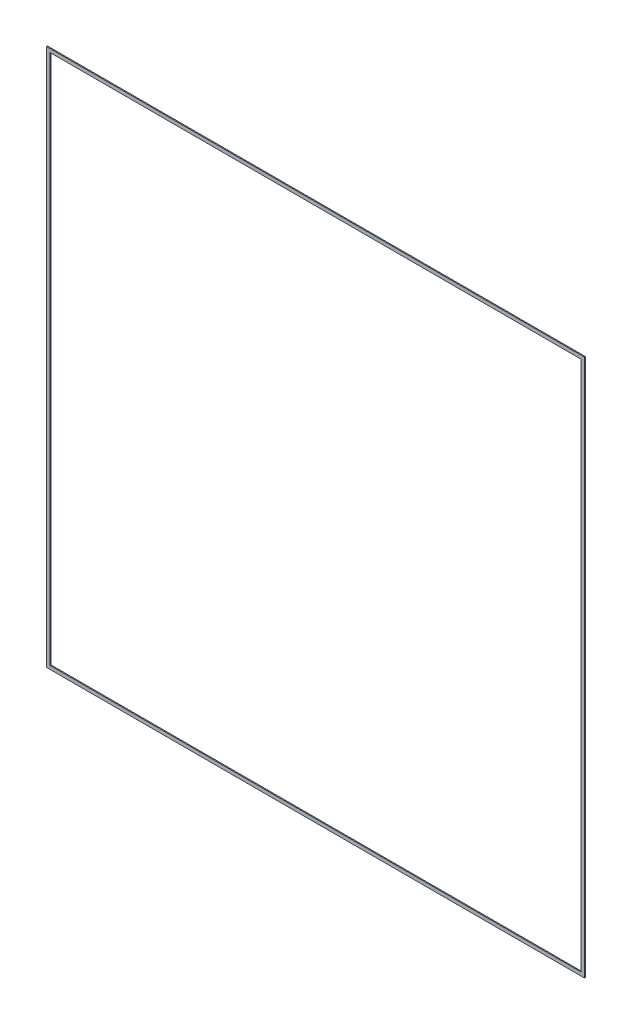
ISO-10303-21;
HEADER;
FILE_DESCRIPTION(('STEP AP214'),'2;1');
FILE_NAME('part.step','',(''),(''),'','','');
FILE_SCHEMA(('AUTOMOTIVE_DESIGN { 1 0 10303 214 1 1 1 1 }'));
ENDSEC;
DATA;
#1=APPLICATION_CONTEXT('core data for automotive mechanical design processes');
#2=APPLICATION_PROTOCOL_DEFINITION('international standard','automotive_design',2000,#1);
#3=PRODUCT_CONTEXT('',#1,'mechanical');
#4=PRODUCT('Part','Part','',(#3));
#5=PRODUCT_RELATED_PRODUCT_CATEGORY('part','',(#4));
#6=PRODUCT_DEFINITION_FORMATION('','',#4);
#7=PRODUCT_DEFINITION_CONTEXT('part definition',#1,'design');
#8=PRODUCT_DEFINITION('design','',#6,#7);
#9=PRODUCT_DEFINITION_SHAPE('','',#8);
#10=(LENGTH_UNIT() NAMED_UNIT(*) SI_UNIT(.MILLI.,.METRE.));
#11=(NAMED_UNIT(*) PLANE_ANGLE_UNIT() SI_UNIT($,.RADIAN.));
#12=(NAMED_UNIT(*) SI_UNIT($,.STERADIAN.) SOLID_ANGLE_UNIT());
#13=UNCERTAINTY_MEASURE_WITH_UNIT(LENGTH_MEASURE(1.E-05),#10,'distance_accuracy_value','');
#14=(GEOMETRIC_REPRESENTATION_CONTEXT(3) GLOBAL_UNCERTAINTY_ASSIGNED_CONTEXT((#13)) GLOBAL_UNIT_ASSIGNED_CONTEXT((#10,
#11,#12)) REPRESENTATION_CONTEXT('',''));
#15=CARTESIAN_POINT('',(0.,0.,0.));
#16=DIRECTION('',(0.,0.,1.));
#17=DIRECTION('',(1.,0.,0.));
#18=AXIS2_PLACEMENT_3D('',#15,#16,#17);
#19=CARTESIAN_POINT('',(0.,0.,3.));
#20=DIRECTION('',(0.,0.,1.));
#21=DIRECTION('',(1.,0.,0.));
#22=AXIS2_PLACEMENT_3D('',#19,#20,#21);
#23=PLANE('',#22);
#24=DIRECTION('',(0.,-1.,0.));
#25=VECTOR('',#24,1.);
#26=CARTESIAN_POINT('',(-830.,830.,3.));
#27=LINE('',#26,#25);
#28=CARTESIAN_POINT('',(-830.,830.,3.));
#29=VERTEX_POINT('',#28);
#30=CARTESIAN_POINT('',(-830.,-830.,3.));
#31=VERTEX_POINT('',#30);
#32=EDGE_CURVE('E25',#29,#31,#27,.T.);
#33=ORIENTED_EDGE('',*,*,#32,.F.);
#34=DIRECTION('',(-1.,0.,0.));
#35=VECTOR('',#34,1.);
#36=CARTESIAN_POINT('',(830.,830.,3.));
#37=LINE('',#36,#35);
#38=CARTESIAN_POINT('',(830.,830.,3.));
#39=VERTEX_POINT('',#38);
#40=EDGE_CURVE('E63',#39,#29,#37,.T.);
#41=ORIENTED_EDGE('',*,*,#40,.F.);
#42=DIRECTION('',(0.,1.,0.));
#43=VECTOR('',#42,1.);
#44=CARTESIAN_POINT('',(830.,-830.,3.));
#45=LINE('',#44,#43);
#46=CARTESIAN_POINT('',(830.,-830.,3.));
#47=VERTEX_POINT('',#46);
#48=EDGE_CURVE('E183',#47,#39,#45,.T.);
#49=ORIENTED_EDGE('',*,*,#48,.F.);
#50=DIRECTION('',(1.,0.,0.));
#51=VECTOR('',#50,1.);
#52=CARTESIAN_POINT('',(-830.,-830.,3.));
#53=LINE('',#52,#51);
#54=EDGE_CURVE('E166',#31,#47,#53,.T.);
#55=ORIENTED_EDGE('',*,*,#54,.F.);
#56=EDGE_LOOP('',(#33,#41,#49,#55));
#57=FACE_BOUND('',#56,.T.);
#58=DIRECTION('',(1.,0.,0.));
#59=VECTOR('',#58,1.);
#60=CARTESIAN_POINT('',(-841.,-841.,3.));
#61=LINE('',#60,#59);
#62=CARTESIAN_POINT('',(-841.,-841.,3.));
#63=VERTEX_POINT('',#62);
#64=CARTESIAN_POINT('',(841.,-841.,3.));
#65=VERTEX_POINT('',#64);
#66=EDGE_CURVE('E134',#63,#65,#61,.T.);
#67=ORIENTED_EDGE('',*,*,#66,.T.);
#68=DIRECTION('',(0.,1.,0.));
#69=VECTOR('',#68,1.);
#70=CARTESIAN_POINT('',(841.,-841.,3.));
#71=LINE('',#70,#69);
#72=CARTESIAN_POINT('',(841.,841.,3.));
#73=VERTEX_POINT('',#72);
#74=EDGE_CURVE('E153',#65,#73,#71,.T.);
#75=ORIENTED_EDGE('',*,*,#74,.T.);
#76=DIRECTION('',(-1.,0.,0.));
#77=VECTOR('',#76,1.);
#78=CARTESIAN_POINT('',(841.,841.,3.));
#79=LINE('',#78,#77);
#80=CARTESIAN_POINT('',(-841.,841.,3.));
#81=VERTEX_POINT('',#80);
#82=EDGE_CURVE('E126',#73,#81,#79,.T.);
#83=ORIENTED_EDGE('',*,*,#82,.T.);
#84=DIRECTION('',(0.,-1.,0.));
#85=VECTOR('',#84,1.);
#86=CARTESIAN_POINT('',(-841.,841.,3.));
#87=LINE('',#86,#85);
#88=EDGE_CURVE('E88',#81,#63,#87,.T.);
#89=ORIENTED_EDGE('',*,*,#88,.T.);
#90=EDGE_LOOP('',(#67,#75,#83,#89));
#91=FACE_BOUND('',#90,.T.);
#92=ADVANCED_FACE('F16',(#57,#91),#23,.T.);
#93=CARTESIAN_POINT('',(0.,0.,0.));
#94=DIRECTION('',(0.,0.,1.));
#95=DIRECTION('',(1.,0.,0.));
#96=AXIS2_PLACEMENT_3D('',#93,#94,#95);
#97=PLANE('',#96);
#98=DIRECTION('',(1.,0.,0.));
#99=VECTOR('',#98,1.);
#100=CARTESIAN_POINT('',(-830.,-830.,0.));
#101=LINE('',#100,#99);
#102=CARTESIAN_POINT('',(-830.,-830.,0.));
#103=VERTEX_POINT('',#102);
#104=CARTESIAN_POINT('',(830.,-830.,0.));
#105=VERTEX_POINT('',#104);
#106=EDGE_CURVE('E165',#103,#105,#101,.T.);
#107=ORIENTED_EDGE('',*,*,#106,.T.);
#108=DIRECTION('',(0.,1.,0.));
#109=VECTOR('',#108,1.);
#110=CARTESIAN_POINT('',(830.,-830.,0.));
#111=LINE('',#110,#109);
#112=CARTESIAN_POINT('',(830.,830.,0.));
#113=VERTEX_POINT('',#112);
#114=EDGE_CURVE('E190',#105,#113,#111,.T.);
#115=ORIENTED_EDGE('',*,*,#114,.T.);
#116=DIRECTION('',(-1.,0.,0.));
#117=VECTOR('',#116,1.);
#118=CARTESIAN_POINT('',(830.,830.,0.));
#119=LINE('',#118,#117);
#120=CARTESIAN_POINT('',(-830.,830.,0.));
#121=VERTEX_POINT('',#120);
#122=EDGE_CURVE('E52',#113,#121,#119,.T.);
#123=ORIENTED_EDGE('',*,*,#122,.T.);
#124=DIRECTION('',(0.,-1.,0.));
#125=VECTOR('',#124,1.);
#126=CARTESIAN_POINT('',(-830.,830.,0.));
#127=LINE('',#126,#125);
#128=EDGE_CURVE('E10',#121,#103,#127,.T.);
#129=ORIENTED_EDGE('',*,*,#128,.T.);
#130=EDGE_LOOP('',(#107,#115,#123,#129));
#131=FACE_BOUND('',#130,.T.);
#132=DIRECTION('',(0.,-1.,0.));
#133=VECTOR('',#132,1.);
#134=CARTESIAN_POINT('',(-841.,841.,0.));
#135=LINE('',#134,#133);
#136=CARTESIAN_POINT('',(-841.,841.,0.));
#137=VERTEX_POINT('',#136);
#138=CARTESIAN_POINT('',(-841.,-841.,0.));
#139=VERTEX_POINT('',#138);
#140=EDGE_CURVE('E115',#137,#139,#135,.T.);
#141=ORIENTED_EDGE('',*,*,#140,.F.);
#142=DIRECTION('',(-1.,0.,0.));
#143=VECTOR('',#142,1.);
#144=CARTESIAN_POINT('',(841.,841.,0.));
#145=LINE('',#144,#143);
#146=CARTESIAN_POINT('',(841.,841.,0.));
#147=VERTEX_POINT('',#146);
#148=EDGE_CURVE('E152',#147,#137,#145,.T.);
#149=ORIENTED_EDGE('',*,*,#148,.F.);
#150=DIRECTION('',(0.,1.,0.));
#151=VECTOR('',#150,1.);
#152=CARTESIAN_POINT('',(841.,-841.,0.));
#153=LINE('',#152,#151);
#154=CARTESIAN_POINT('',(841.,-841.,0.));
#155=VERTEX_POINT('',#154);
#156=EDGE_CURVE('E136',#155,#147,#153,.T.);
#157=ORIENTED_EDGE('',*,*,#156,.F.);
#158=DIRECTION('',(1.,0.,0.));
#159=VECTOR('',#158,1.);
#160=CARTESIAN_POINT('',(-841.,-841.,0.));
#161=LINE('',#160,#159);
#162=EDGE_CURVE('E132',#139,#155,#161,.T.);
#163=ORIENTED_EDGE('',*,*,#162,.F.);
#164=EDGE_LOOP('',(#141,#149,#157,#163));
#165=FACE_BOUND('',#164,.T.);
#166=ADVANCED_FACE('F138',(#131,#165),#97,.F.);
#167=CARTESIAN_POINT('',(-830.,830.,0.));
#168=DIRECTION('',(1.,0.,0.));
#169=DIRECTION('',(0.,1.,0.));
#170=AXIS2_PLACEMENT_3D('',#167,#168,#169);
#171=PLANE('',#170);
#172=DIRECTION('',(0.,0.,1.));
#173=VECTOR('',#172,1.);
#174=CARTESIAN_POINT('',(-830.,830.,0.));
#175=LINE('',#174,#173);
#176=EDGE_CURVE('E195',#121,#29,#175,.T.);
#177=ORIENTED_EDGE('',*,*,#176,.T.);
#178=ORIENTED_EDGE('',*,*,#32,.T.);
#179=DIRECTION('',(0.,0.,1.));
#180=VECTOR('',#179,1.);
#181=CARTESIAN_POINT('',(-830.,-830.,0.));
#182=LINE('',#181,#180);
#183=EDGE_CURVE('E151',#103,#31,#182,.T.);
#184=ORIENTED_EDGE('',*,*,#183,.F.);
#185=ORIENTED_EDGE('',*,*,#128,.F.);
#186=EDGE_LOOP('',(#177,#178,#184,#185));
#187=FACE_BOUND('',#186,.T.);
#188=ADVANCED_FACE('F233',(#187),#171,.T.);
#189=CARTESIAN_POINT('',(830.,830.,0.));
#190=DIRECTION('',(0.,-1.,0.));
#191=DIRECTION('',(0.,0.,-1.));
#192=AXIS2_PLACEMENT_3D('',#189,#190,#191);
#193=PLANE('',#192);
#194=DIRECTION('',(0.,0.,1.));
#195=VECTOR('',#194,1.);
#196=CARTESIAN_POINT('',(830.,830.,0.));
#197=LINE('',#196,#195);
#198=EDGE_CURVE('E187',#113,#39,#197,.T.);
#199=ORIENTED_EDGE('',*,*,#198,.T.);
#200=ORIENTED_EDGE('',*,*,#40,.T.);
#201=ORIENTED_EDGE('',*,*,#176,.F.);
#202=ORIENTED_EDGE('',*,*,#122,.F.);
#203=EDGE_LOOP('',(#199,#200,#201,#202));
#204=FACE_BOUND('',#203,.T.);
#205=ADVANCED_FACE('F238',(#204),#193,.T.);
#206=CARTESIAN_POINT('',(830.,-830.,0.));
#207=DIRECTION('',(-1.,0.,0.));
#208=DIRECTION('',(0.,0.,1.));
#209=AXIS2_PLACEMENT_3D('',#206,#207,#208);
#210=PLANE('',#209);
#211=DIRECTION('',(0.,0.,1.));
#212=VECTOR('',#211,1.);
#213=CARTESIAN_POINT('',(830.,-830.,0.));
#214=LINE('',#213,#212);
#215=EDGE_CURVE('E161',#105,#47,#214,.T.);
#216=ORIENTED_EDGE('',*,*,#215,.T.);
#217=ORIENTED_EDGE('',*,*,#48,.T.);
#218=ORIENTED_EDGE('',*,*,#198,.F.);
#219=ORIENTED_EDGE('',*,*,#114,.F.);
#220=EDGE_LOOP('',(#216,#217,#218,#219));
#221=FACE_BOUND('',#220,.T.);
#222=ADVANCED_FACE('F255',(#221),#210,.T.);
#223=CARTESIAN_POINT('',(-830.,-830.,0.));
#224=DIRECTION('',(0.,1.,0.));
#225=DIRECTION('',(1.,0.,0.));
#226=AXIS2_PLACEMENT_3D('',#223,#224,#225);
#227=PLANE('',#226);
#228=ORIENTED_EDGE('',*,*,#183,.T.);
#229=ORIENTED_EDGE('',*,*,#54,.T.);
#230=ORIENTED_EDGE('',*,*,#215,.F.);
#231=ORIENTED_EDGE('',*,*,#106,.F.);
#232=EDGE_LOOP('',(#228,#229,#230,#231));
#233=FACE_BOUND('',#232,.T.);
#234=ADVANCED_FACE('F247',(#233),#227,.T.);
#235=CARTESIAN_POINT('',(-841.,841.,0.));
#236=DIRECTION('',(1.,0.,0.));
#237=DIRECTION('',(0.,1.,0.));
#238=AXIS2_PLACEMENT_3D('',#235,#236,#237);
#239=PLANE('',#238);
#240=ORIENTED_EDGE('',*,*,#140,.T.);
#241=DIRECTION('',(0.,0.,1.));
#242=VECTOR('',#241,1.);
#243=CARTESIAN_POINT('',(-841.,-841.,0.));
#244=LINE('',#243,#242);
#245=EDGE_CURVE('E118',#139,#63,#244,.T.);
#246=ORIENTED_EDGE('',*,*,#245,.T.);
#247=ORIENTED_EDGE('',*,*,#88,.F.);
#248=DIRECTION('',(0.,0.,1.));
#249=VECTOR('',#248,1.);
#250=CARTESIAN_POINT('',(-841.,841.,0.));
#251=LINE('',#250,#249);
#252=EDGE_CURVE('E121',#137,#81,#251,.T.);
#253=ORIENTED_EDGE('',*,*,#252,.F.);
#254=EDGE_LOOP('',(#240,#246,#247,#253));
#255=FACE_BOUND('',#254,.T.);
#256=ADVANCED_FACE('F117',(#255),#239,.F.);
#257=CARTESIAN_POINT('',(841.,841.,0.));
#258=DIRECTION('',(0.,-1.,0.));
#259=DIRECTION('',(0.,0.,-1.));
#260=AXIS2_PLACEMENT_3D('',#257,#258,#259);
#261=PLANE('',#260);
#262=ORIENTED_EDGE('',*,*,#148,.T.);
#263=ORIENTED_EDGE('',*,*,#252,.T.);
#264=ORIENTED_EDGE('',*,*,#82,.F.);
#265=DIRECTION('',(0.,0.,1.));
#266=VECTOR('',#265,1.);
#267=CARTESIAN_POINT('',(841.,841.,0.));
#268=LINE('',#267,#266);
#269=EDGE_CURVE('E160',#147,#73,#268,.T.);
#270=ORIENTED_EDGE('',*,*,#269,.F.);
#271=EDGE_LOOP('',(#262,#263,#264,#270));
#272=FACE_BOUND('',#271,.T.);
#273=ADVANCED_FACE('F219',(#272),#261,.F.);
#274=CARTESIAN_POINT('',(841.,-841.,0.));
#275=DIRECTION('',(-1.,0.,0.));
#276=DIRECTION('',(0.,0.,1.));
#277=AXIS2_PLACEMENT_3D('',#274,#275,#276);
#278=PLANE('',#277);
#279=ORIENTED_EDGE('',*,*,#156,.T.);
#280=ORIENTED_EDGE('',*,*,#269,.T.);
#281=ORIENTED_EDGE('',*,*,#74,.F.);
#282=DIRECTION('',(0.,0.,1.));
#283=VECTOR('',#282,1.);
#284=CARTESIAN_POINT('',(841.,-841.,0.));
#285=LINE('',#284,#283);
#286=EDGE_CURVE('E142',#155,#65,#285,.T.);
#287=ORIENTED_EDGE('',*,*,#286,.F.);
#288=EDGE_LOOP('',(#279,#280,#281,#287));
#289=FACE_BOUND('',#288,.T.);
#290=ADVANCED_FACE('F210',(#289),#278,.F.);
#291=CARTESIAN_POINT('',(-841.,-841.,0.));
#292=DIRECTION('',(0.,1.,0.));
#293=DIRECTION('',(1.,0.,0.));
#294=AXIS2_PLACEMENT_3D('',#291,#292,#293);
#295=PLANE('',#294);
#296=ORIENTED_EDGE('',*,*,#162,.T.);
#297=ORIENTED_EDGE('',*,*,#286,.T.);
#298=ORIENTED_EDGE('',*,*,#66,.F.);
#299=ORIENTED_EDGE('',*,*,#245,.F.);
#300=EDGE_LOOP('',(#296,#297,#298,#299));
#301=FACE_BOUND('',#300,.T.);
#302=ADVANCED_FACE('F130',(#301),#295,.F.);
#303=CLOSED_SHELL('',(#92,#166,#188,#205,#222,#234,#256,#273,#290,#302));
#304=MANIFOLD_SOLID_BREP('B1',#303);
#305=ADVANCED_BREP_SHAPE_REPRESENTATION('',(#18,#304),#14);
#306=SHAPE_DEFINITION_REPRESENTATION(#9,#305);
ENDSEC;
END-ISO-10303-21;
